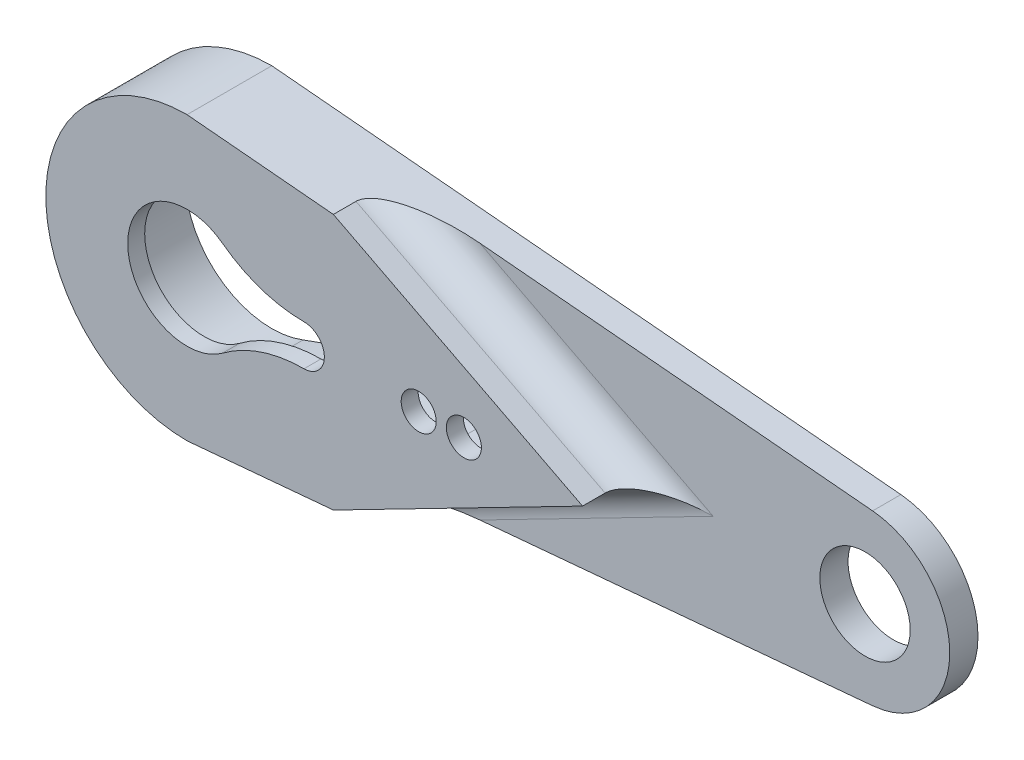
ISO-10303-21;
HEADER;
FILE_DESCRIPTION(('STEP AP214'),'2;1');
FILE_NAME('part.step','',(''),(''),'','','');
FILE_SCHEMA(('AUTOMOTIVE_DESIGN { 1 0 10303 214 1 1 1 1 }'));
ENDSEC;
DATA;
#1=APPLICATION_CONTEXT('core data for automotive mechanical design processes');
#2=APPLICATION_PROTOCOL_DEFINITION('international standard','automotive_design',2000,#1);
#3=PRODUCT_CONTEXT('',#1,'mechanical');
#4=PRODUCT('Part','Part','',(#3));
#5=PRODUCT_RELATED_PRODUCT_CATEGORY('part','',(#4));
#6=PRODUCT_DEFINITION_FORMATION('','',#4);
#7=PRODUCT_DEFINITION_CONTEXT('part definition',#1,'design');
#8=PRODUCT_DEFINITION('design','',#6,#7);
#9=PRODUCT_DEFINITION_SHAPE('','',#8);
#10=(LENGTH_UNIT() NAMED_UNIT(*) SI_UNIT(.MILLI.,.METRE.));
#11=(NAMED_UNIT(*) PLANE_ANGLE_UNIT() SI_UNIT($,.RADIAN.));
#12=(NAMED_UNIT(*) SI_UNIT($,.STERADIAN.) SOLID_ANGLE_UNIT());
#13=UNCERTAINTY_MEASURE_WITH_UNIT(LENGTH_MEASURE(1.E-05),#10,'distance_accuracy_value','');
#14=(GEOMETRIC_REPRESENTATION_CONTEXT(3) GLOBAL_UNCERTAINTY_ASSIGNED_CONTEXT((#13)) GLOBAL_UNIT_ASSIGNED_CONTEXT((#10,
#11,#12)) REPRESENTATION_CONTEXT('',''));
#15=CARTESIAN_POINT('',(0.,0.,0.));
#16=DIRECTION('',(0.,0.,1.));
#17=DIRECTION('',(1.,0.,0.));
#18=AXIS2_PLACEMENT_3D('',#15,#16,#17);
#19=CARTESIAN_POINT('',(55.,0.,-3.75));
#20=DIRECTION('',(0.,0.,1.));
#21=DIRECTION('',(1.,0.,0.));
#22=AXIS2_PLACEMENT_3D('',#19,#20,#21);
#23=CYLINDRICAL_SURFACE('',#22,7.5);
#24=CARTESIAN_POINT('',(55.,0.,-1.25));
#25=DIRECTION('',(0.,0.,1.));
#26=DIRECTION('',(1.,0.,0.));
#27=AXIS2_PLACEMENT_3D('',#24,#25,#26);
#28=CIRCLE('',#27,7.5);
#29=CARTESIAN_POINT('',(55.6749027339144,-7.46957202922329,-1.25));
#30=VERTEX_POINT('',#29);
#31=CARTESIAN_POINT('',(55.6749027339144,7.46957202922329,-1.25));
#32=VERTEX_POINT('',#31);
#33=EDGE_CURVE('E194',#30,#32,#28,.T.);
#34=ORIENTED_EDGE('',*,*,#33,.F.);
#35=DIRECTION('',(0.,0.,1.));
#36=VECTOR('',#35,1.);
#37=CARTESIAN_POINT('',(55.6749027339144,-7.46957202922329,-3.75));
#38=LINE('',#37,#36);
#39=CARTESIAN_POINT('',(55.6749027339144,-7.46957202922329,-3.75));
#40=VERTEX_POINT('',#39);
#41=EDGE_CURVE('E293',#40,#30,#38,.T.);
#42=ORIENTED_EDGE('',*,*,#41,.F.);
#43=CARTESIAN_POINT('',(55.,0.,-3.75));
#44=DIRECTION('',(0.,0.,1.));
#45=DIRECTION('',(1.,0.,0.));
#46=AXIS2_PLACEMENT_3D('',#43,#44,#45);
#47=CIRCLE('',#46,7.5);
#48=CARTESIAN_POINT('',(55.6749027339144,7.46957202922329,-3.75));
#49=VERTEX_POINT('',#48);
#50=EDGE_CURVE('E282',#49,#40,#47,.F.);
#51=ORIENTED_EDGE('',*,*,#50,.F.);
#52=DIRECTION('',(0.,0.,1.));
#53=VECTOR('',#52,1.);
#54=CARTESIAN_POINT('',(55.6749027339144,7.46957202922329,-3.75));
#55=LINE('',#54,#53);
#56=EDGE_CURVE('E289',#49,#32,#55,.T.);
#57=ORIENTED_EDGE('',*,*,#56,.T.);
#58=EDGE_LOOP('',(#34,#42,#51,#57));
#59=FACE_BOUND('',#58,.T.);
#60=ADVANCED_FACE('F40',(#59),#23,.T.);
#61=CARTESIAN_POINT('',(55.,0.,-3.75));
#62=DIRECTION('',(0.,0.,1.));
#63=DIRECTION('',(1.,0.,0.));
#64=AXIS2_PLACEMENT_3D('',#61,#62,#63);
#65=CYLINDRICAL_SURFACE('',#64,3.99999999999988);
#66=CARTESIAN_POINT('',(55.,0.,-3.75));
#67=DIRECTION('',(0.,0.,1.));
#68=DIRECTION('',(1.,0.,0.));
#69=AXIS2_PLACEMENT_3D('',#66,#67,#68);
#70=CIRCLE('',#69,3.99999999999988);
#71=CARTESIAN_POINT('',(58.9999999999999,0.,-3.75));
#72=VERTEX_POINT('',#71);
#73=EDGE_CURVE('E271',#72,#72,#70,.T.);
#74=ORIENTED_EDGE('',*,*,#73,.F.);
#75=EDGE_LOOP('',(#74));
#76=FACE_BOUND('',#75,.T.);
#77=CARTESIAN_POINT('',(55.,0.,-1.25));
#78=DIRECTION('',(0.,0.,1.));
#79=DIRECTION('',(1.,0.,0.));
#80=AXIS2_PLACEMENT_3D('',#77,#78,#79);
#81=CIRCLE('',#80,3.99999999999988);
#82=CARTESIAN_POINT('',(58.9999999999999,0.,-1.25));
#83=VERTEX_POINT('',#82);
#84=EDGE_CURVE('E190',#83,#83,#81,.F.);
#85=ORIENTED_EDGE('',*,*,#84,.F.);
#86=EDGE_LOOP('',(#85));
#87=FACE_BOUND('',#86,.T.);
#88=ADVANCED_FACE('F366',(#76,#87),#65,.F.);
#89=CARTESIAN_POINT('',(24.5,0.,-3.75));
#90=DIRECTION('',(0.,0.,1.));
#91=DIRECTION('',(1.,0.,0.));
#92=AXIS2_PLACEMENT_3D('',#89,#90,#91);
#93=CYLINDRICAL_SURFACE('',#92,3.80000000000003);
#94=CARTESIAN_POINT('',(24.5,0.,2.25));
#95=DIRECTION('',(0.,0.,1.));
#96=DIRECTION('',(1.,0.,0.));
#97=AXIS2_PLACEMENT_3D('',#94,#95,#96);
#98=CIRCLE('',#97,3.80000000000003);
#99=CARTESIAN_POINT('',(24.5,-3.80000000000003,2.25));
#100=VERTEX_POINT('',#99);
#101=CARTESIAN_POINT('',(24.5,3.80000000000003,2.25));
#102=VERTEX_POINT('',#101);
#103=EDGE_CURVE('E237',#100,#102,#98,.T.);
#104=ORIENTED_EDGE('',*,*,#103,.T.);
#105=DIRECTION('',(0.,0.,1.));
#106=VECTOR('',#105,1.);
#107=CARTESIAN_POINT('',(24.5,3.80000000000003,-3.75));
#108=LINE('',#107,#106);
#109=CARTESIAN_POINT('',(24.5,3.80000000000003,-3.75));
#110=VERTEX_POINT('',#109);
#111=EDGE_CURVE('E301',#110,#102,#108,.T.);
#112=ORIENTED_EDGE('',*,*,#111,.F.);
#113=CARTESIAN_POINT('',(24.5,0.,-3.75));
#114=DIRECTION('',(0.,0.,1.));
#115=DIRECTION('',(1.,0.,0.));
#116=AXIS2_PLACEMENT_3D('',#113,#114,#115);
#117=CIRCLE('',#116,3.80000000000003);
#118=CARTESIAN_POINT('',(24.5,-3.80000000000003,-3.75));
#119=VERTEX_POINT('',#118);
#120=EDGE_CURVE('E257',#119,#110,#117,.T.);
#121=ORIENTED_EDGE('',*,*,#120,.F.);
#122=DIRECTION('',(0.,0.,1.));
#123=VECTOR('',#122,1.);
#124=CARTESIAN_POINT('',(24.5,-3.80000000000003,-3.75));
#125=LINE('',#124,#123);
#126=EDGE_CURVE('E284',#119,#100,#125,.T.);
#127=ORIENTED_EDGE('',*,*,#126,.T.);
#128=EDGE_LOOP('',(#104,#112,#121,#127));
#129=FACE_BOUND('',#128,.T.);
#130=ADVANCED_FACE('F371',(#129),#93,.F.);
#131=CARTESIAN_POINT('',(0.,3.80000000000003,-3.75));
#132=DIRECTION('',(0.,-1.,0.));
#133=DIRECTION('',(1.,0.,0.));
#134=AXIS2_PLACEMENT_3D('',#131,#132,#133);
#135=PLANE('',#134);
#136=ORIENTED_EDGE('',*,*,#111,.T.);
#137=DIRECTION('',(-1.,0.,0.));
#138=VECTOR('',#137,1.);
#139=CARTESIAN_POINT('',(20.5845093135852,3.80000000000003,2.25));
#140=LINE('',#139,#138);
#141=CARTESIAN_POINT('',(20.5845093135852,3.80000000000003,2.25));
#142=VERTEX_POINT('',#141);
#143=EDGE_CURVE('E245',#102,#142,#140,.T.);
#144=ORIENTED_EDGE('',*,*,#143,.T.);
#145=DIRECTION('',(0.,0.,1.));
#146=VECTOR('',#145,1.);
#147=CARTESIAN_POINT('',(20.5845093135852,3.80000000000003,-3.75));
#148=LINE('',#147,#146);
#149=CARTESIAN_POINT('',(20.5845093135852,3.80000000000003,-3.75));
#150=VERTEX_POINT('',#149);
#151=EDGE_CURVE('E304',#150,#142,#148,.T.);
#152=ORIENTED_EDGE('',*,*,#151,.F.);
#153=DIRECTION('',(1.,0.,0.));
#154=VECTOR('',#153,1.);
#155=CARTESIAN_POINT('',(0.,3.80000000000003,-3.75));
#156=LINE('',#155,#154);
#157=EDGE_CURVE('E268',#150,#110,#156,.T.);
#158=ORIENTED_EDGE('',*,*,#157,.T.);
#159=EDGE_LOOP('',(#136,#144,#152,#158));
#160=FACE_BOUND('',#159,.T.);
#161=ADVANCED_FACE('F421',(#160),#135,.T.);
#162=CARTESIAN_POINT('',(20.5845093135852,53.103834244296,-3.75));
#163=DIRECTION('',(0.,0.,1.));
#164=DIRECTION('',(1.,0.,0.));
#165=AXIS2_PLACEMENT_3D('',#162,#163,#164);
#166=CYLINDRICAL_SURFACE('',#165,49.303834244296);
#167=ORIENTED_EDGE('',*,*,#151,.T.);
#168=CARTESIAN_POINT('',(20.5845093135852,53.103834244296,2.25));
#169=DIRECTION('',(0.,0.,-1.));
#170=DIRECTION('',(1.,0.,0.));
#171=AXIS2_PLACEMENT_3D('',#168,#169,#170);
#172=CIRCLE('',#171,49.303834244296);
#173=CARTESIAN_POINT('',(2.76489718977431,7.13287063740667,2.25));
#174=VERTEX_POINT('',#173);
#175=EDGE_CURVE('E247',#142,#174,#172,.T.);
#176=ORIENTED_EDGE('',*,*,#175,.T.);
#177=DIRECTION('',(0.,0.,1.));
#178=VECTOR('',#177,1.);
#179=CARTESIAN_POINT('',(2.76489718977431,7.13287063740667,-3.75));
#180=LINE('',#179,#178);
#181=CARTESIAN_POINT('',(2.76489718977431,7.13287063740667,-3.75));
#182=VERTEX_POINT('',#181);
#183=EDGE_CURVE('E307',#182,#174,#180,.T.);
#184=ORIENTED_EDGE('',*,*,#183,.F.);
#185=CARTESIAN_POINT('',(20.5845093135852,53.103834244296,-3.75));
#186=DIRECTION('',(0.,0.,1.));
#187=DIRECTION('',(1.,0.,0.));
#188=AXIS2_PLACEMENT_3D('',#185,#186,#187);
#189=CIRCLE('',#188,49.303834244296);
#190=EDGE_CURVE('E265',#182,#150,#189,.T.);
#191=ORIENTED_EDGE('',*,*,#190,.T.);
#192=EDGE_LOOP('',(#167,#176,#184,#191));
#193=FACE_BOUND('',#192,.T.);
#194=ADVANCED_FACE('F434',(#193),#166,.T.);
#195=CARTESIAN_POINT('',(0.,0.,-3.75));
#196=DIRECTION('',(0.,0.,1.));
#197=DIRECTION('',(1.,0.,0.));
#198=AXIS2_PLACEMENT_3D('',#195,#196,#197);
#199=CYLINDRICAL_SURFACE('',#198,7.65000000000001);
#200=CARTESIAN_POINT('',(0.,0.,2.25));
#201=DIRECTION('',(0.,0.,1.));
#202=DIRECTION('',(1.,0.,0.));
#203=AXIS2_PLACEMENT_3D('',#200,#201,#202);
#204=CIRCLE('',#203,7.65000000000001);
#205=CARTESIAN_POINT('',(2.76489718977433,-7.13287063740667,2.25));
#206=VERTEX_POINT('',#205);
#207=EDGE_CURVE('E249',#174,#206,#204,.T.);
#208=ORIENTED_EDGE('',*,*,#207,.T.);
#209=DIRECTION('',(0.,0.,1.));
#210=VECTOR('',#209,1.);
#211=CARTESIAN_POINT('',(2.76489718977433,-7.13287063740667,-3.75));
#212=LINE('',#211,#210);
#213=CARTESIAN_POINT('',(2.76489718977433,-7.13287063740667,-3.75));
#214=VERTEX_POINT('',#213);
#215=EDGE_CURVE('E310',#214,#206,#212,.T.);
#216=ORIENTED_EDGE('',*,*,#215,.F.);
#217=CARTESIAN_POINT('',(0.,0.,-3.75));
#218=DIRECTION('',(0.,0.,1.));
#219=DIRECTION('',(1.,0.,0.));
#220=AXIS2_PLACEMENT_3D('',#217,#218,#219);
#221=CIRCLE('',#220,7.65000000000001);
#222=EDGE_CURVE('E263',#182,#214,#221,.T.);
#223=ORIENTED_EDGE('',*,*,#222,.F.);
#224=ORIENTED_EDGE('',*,*,#183,.T.);
#225=EDGE_LOOP('',(#208,#216,#223,#224));
#226=FACE_BOUND('',#225,.T.);
#227=ADVANCED_FACE('F430',(#226),#199,.F.);
#228=CARTESIAN_POINT('',(20.5845093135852,-53.103834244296,-3.75));
#229=DIRECTION('',(0.,0.,1.));
#230=DIRECTION('',(1.,0.,0.));
#231=AXIS2_PLACEMENT_3D('',#228,#229,#230);
#232=CYLINDRICAL_SURFACE('',#231,49.303834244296);
#233=CARTESIAN_POINT('',(20.5845093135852,-53.103834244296,2.25));
#234=DIRECTION('',(0.,0.,-1.));
#235=DIRECTION('',(1.,0.,0.));
#236=AXIS2_PLACEMENT_3D('',#233,#234,#235);
#237=CIRCLE('',#236,49.303834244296);
#238=CARTESIAN_POINT('',(20.5845093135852,-3.80000000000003,2.25));
#239=VERTEX_POINT('',#238);
#240=EDGE_CURVE('E251',#206,#239,#237,.T.);
#241=ORIENTED_EDGE('',*,*,#240,.T.);
#242=DIRECTION('',(0.,0.,1.));
#243=VECTOR('',#242,1.);
#244=CARTESIAN_POINT('',(20.5845093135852,-3.80000000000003,-3.75));
#245=LINE('',#244,#243);
#246=CARTESIAN_POINT('',(20.5845093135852,-3.80000000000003,-3.75));
#247=VERTEX_POINT('',#246);
#248=EDGE_CURVE('E313',#247,#239,#245,.T.);
#249=ORIENTED_EDGE('',*,*,#248,.F.);
#250=CARTESIAN_POINT('',(20.5845093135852,-53.103834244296,-3.75));
#251=DIRECTION('',(0.,0.,1.));
#252=DIRECTION('',(1.,0.,0.));
#253=AXIS2_PLACEMENT_3D('',#250,#251,#252);
#254=CIRCLE('',#253,49.303834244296);
#255=EDGE_CURVE('E261',#214,#247,#254,.F.);
#256=ORIENTED_EDGE('',*,*,#255,.F.);
#257=ORIENTED_EDGE('',*,*,#215,.T.);
#258=EDGE_LOOP('',(#241,#249,#256,#257));
#259=FACE_BOUND('',#258,.T.);
#260=ADVANCED_FACE('F426',(#259),#232,.T.);
#261=CARTESIAN_POINT('',(0.,-3.80000000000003,-3.75));
#262=DIRECTION('',(0.,-1.,0.));
#263=DIRECTION('',(0.,0.,-1.));
#264=AXIS2_PLACEMENT_3D('',#261,#262,#263);
#265=PLANE('',#264);
#266=DIRECTION('',(1.,0.,0.));
#267=VECTOR('',#266,1.);
#268=CARTESIAN_POINT('',(20.5845093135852,-3.80000000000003,2.25));
#269=LINE('',#268,#267);
#270=EDGE_CURVE('E254',#239,#100,#269,.T.);
#271=ORIENTED_EDGE('',*,*,#270,.T.);
#272=ORIENTED_EDGE('',*,*,#126,.F.);
#273=DIRECTION('',(1.,0.,0.));
#274=VECTOR('',#273,1.);
#275=CARTESIAN_POINT('',(0.,-3.80000000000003,-3.75));
#276=LINE('',#275,#274);
#277=EDGE_CURVE('E259',#247,#119,#276,.T.);
#278=ORIENTED_EDGE('',*,*,#277,.F.);
#279=ORIENTED_EDGE('',*,*,#248,.T.);
#280=EDGE_LOOP('',(#271,#272,#278,#279));
#281=FACE_BOUND('',#280,.T.);
#282=ADVANCED_FACE('F423',(#281),#265,.F.);
#283=CARTESIAN_POINT('',(1.12027435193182,12.3987791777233,-3.75));
#284=DIRECTION('',(-0.0899870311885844,-0.995942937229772,0.));
#285=DIRECTION('',(0.995942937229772,-0.0899870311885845,0.));
#286=AXIS2_PLACEMENT_3D('',#283,#284,#285);
#287=PLANE('',#286);
#288=DIRECTION('',(0.995942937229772,-0.0899870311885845,0.));
#289=VECTOR('',#288,1.);
#290=CARTESIAN_POINT('',(1.12027435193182,12.3987791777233,3.75));
#291=LINE('',#290,#289);
#292=CARTESIAN_POINT('',(0.,12.5,3.75));
#293=VERTEX_POINT('',#292);
#294=CARTESIAN_POINT('',(12.9502697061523,11.329896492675,3.75));
#295=VERTEX_POINT('',#294);
#296=EDGE_CURVE('E256',#293,#295,#291,.T.);
#297=ORIENTED_EDGE('',*,*,#296,.T.);
#298=DIRECTION('',(0.,0.,1.));
#299=VECTOR('',#298,1.);
#300=CARTESIAN_POINT('',(12.9502697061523,11.329896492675,-1.25));
#301=LINE('',#300,#299);
#302=CARTESIAN_POINT('',(12.9502697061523,11.329896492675,1.75));
#303=VERTEX_POINT('',#302);
#304=EDGE_CURVE('E177',#303,#295,#301,.T.);
#305=ORIENTED_EDGE('',*,*,#304,.F.);
#306=CARTESIAN_POINT('',(20.9149072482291,10.6102628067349,1.75));
#307=DIRECTION('',(-0.0899870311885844,-0.995942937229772,0.));
#308=DIRECTION('',(0.995942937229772,-0.0899870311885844,0.));
#309=AXIS2_PLACEMENT_3D('',#306,#307,#308);
#310=ELLIPSE('',#309,7.99708220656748,3.);
#311=CARTESIAN_POINT('',(20.9149072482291,10.6102628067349,-1.25));
#312=VERTEX_POINT('',#311);
#313=EDGE_CURVE('E11',#303,#312,#310,.T.);
#314=ORIENTED_EDGE('',*,*,#313,.T.);
#315=DIRECTION('',(-0.995942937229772,0.0899870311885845,0.));
#316=VECTOR('',#315,1.);
#317=CARTESIAN_POINT('',(1.12027435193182,12.3987791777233,-1.25));
#318=LINE('',#317,#316);
#319=EDGE_CURVE('E196',#32,#312,#318,.T.);
#320=ORIENTED_EDGE('',*,*,#319,.F.);
#321=ORIENTED_EDGE('',*,*,#56,.F.);
#322=DIRECTION('',(0.995942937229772,-0.0899870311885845,0.));
#323=VECTOR('',#322,1.);
#324=CARTESIAN_POINT('',(1.12027435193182,12.3987791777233,-3.75));
#325=LINE('',#324,#323);
#326=CARTESIAN_POINT('',(0.,12.5,-3.75));
#327=VERTEX_POINT('',#326);
#328=EDGE_CURVE('E274',#327,#49,#325,.T.);
#329=ORIENTED_EDGE('',*,*,#328,.F.);
#330=DIRECTION('',(0.,0.,1.));
#331=VECTOR('',#330,1.);
#332=CARTESIAN_POINT('',(0.,12.5,-3.75));
#333=LINE('',#332,#331);
#334=EDGE_CURVE('E299',#327,#293,#333,.T.);
#335=ORIENTED_EDGE('',*,*,#334,.T.);
#336=EDGE_LOOP('',(#297,#305,#314,#320,#321,#329,#335));
#337=FACE_BOUND('',#336,.T.);
#338=ADVANCED_FACE('F338',(#337),#287,.F.);
#339=CARTESIAN_POINT('',(1.12027435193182,-12.3987791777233,-3.75));
#340=DIRECTION('',(-0.0899870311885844,0.995942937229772,0.));
#341=DIRECTION('',(-0.995942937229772,-0.0899870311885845,0.));
#342=AXIS2_PLACEMENT_3D('',#339,#340,#341);
#343=PLANE('',#342);
#344=DIRECTION('',(0.995942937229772,0.0899870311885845,0.));
#345=VECTOR('',#344,1.);
#346=CARTESIAN_POINT('',(1.12027435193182,-12.3987791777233,-1.25));
#347=LINE('',#346,#345);
#348=CARTESIAN_POINT('',(20.9149072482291,-10.6102628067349,-1.25));
#349=VERTEX_POINT('',#348);
#350=EDGE_CURVE('E192',#349,#30,#347,.T.);
#351=ORIENTED_EDGE('',*,*,#350,.F.);
#352=CARTESIAN_POINT('',(20.9149072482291,-10.6102628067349,1.75));
#353=DIRECTION('',(-0.0899870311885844,0.995942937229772,0.));
#354=DIRECTION('',(-0.995942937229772,-0.0899870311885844,0.));
#355=AXIS2_PLACEMENT_3D('',#352,#353,#354);
#356=ELLIPSE('',#355,7.99708220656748,3.);
#357=CARTESIAN_POINT('',(12.9502697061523,-11.329896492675,1.75));
#358=VERTEX_POINT('',#357);
#359=EDGE_CURVE('E49',#349,#358,#356,.T.);
#360=ORIENTED_EDGE('',*,*,#359,.T.);
#361=DIRECTION('',(0.,0.,1.));
#362=VECTOR('',#361,1.);
#363=CARTESIAN_POINT('',(12.9502697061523,-11.329896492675,-1.25));
#364=LINE('',#363,#362);
#365=CARTESIAN_POINT('',(12.9502697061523,-11.329896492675,3.75));
#366=VERTEX_POINT('',#365);
#367=EDGE_CURVE('E187',#358,#366,#364,.T.);
#368=ORIENTED_EDGE('',*,*,#367,.T.);
#369=DIRECTION('',(-0.995942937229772,-0.0899870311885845,0.));
#370=VECTOR('',#369,1.);
#371=CARTESIAN_POINT('',(1.12027435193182,-12.3987791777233,3.75));
#372=LINE('',#371,#370);
#373=CARTESIAN_POINT('',(0.,-12.5,3.75));
#374=VERTEX_POINT('',#373);
#375=EDGE_CURVE('E185',#366,#374,#372,.T.);
#376=ORIENTED_EDGE('',*,*,#375,.T.);
#377=DIRECTION('',(0.,0.,1.));
#378=VECTOR('',#377,1.);
#379=CARTESIAN_POINT('',(0.,-12.5,-3.75));
#380=LINE('',#379,#378);
#381=CARTESIAN_POINT('',(0.,-12.5,-3.75));
#382=VERTEX_POINT('',#381);
#383=EDGE_CURVE('E296',#382,#374,#380,.T.);
#384=ORIENTED_EDGE('',*,*,#383,.F.);
#385=DIRECTION('',(-0.995942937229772,-0.0899870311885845,0.));
#386=VECTOR('',#385,1.);
#387=CARTESIAN_POINT('',(1.12027435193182,-12.3987791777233,-3.75));
#388=LINE('',#387,#386);
#389=EDGE_CURVE('E280',#40,#382,#388,.T.);
#390=ORIENTED_EDGE('',*,*,#389,.F.);
#391=ORIENTED_EDGE('',*,*,#41,.T.);
#392=EDGE_LOOP('',(#351,#360,#368,#376,#384,#390,#391));
#393=FACE_BOUND('',#392,.T.);
#394=ADVANCED_FACE('F327',(#393),#343,.F.);
#395=CARTESIAN_POINT('',(0.,0.,-3.75));
#396=DIRECTION('',(0.,0.,1.));
#397=DIRECTION('',(1.,0.,0.));
#398=AXIS2_PLACEMENT_3D('',#395,#396,#397);
#399=CYLINDRICAL_SURFACE('',#398,12.5);
#400=CARTESIAN_POINT('',(0.,0.,3.75));
#401=DIRECTION('',(0.,0.,1.));
#402=DIRECTION('',(1.,0.,0.));
#403=AXIS2_PLACEMENT_3D('',#400,#401,#402);
#404=CIRCLE('',#403,12.5);
#405=EDGE_CURVE('E286',#293,#374,#404,.T.);
#406=ORIENTED_EDGE('',*,*,#405,.F.);
#407=ORIENTED_EDGE('',*,*,#334,.F.);
#408=CARTESIAN_POINT('',(0.,0.,-3.75));
#409=DIRECTION('',(0.,0.,1.));
#410=DIRECTION('',(1.,0.,0.));
#411=AXIS2_PLACEMENT_3D('',#408,#409,#410);
#412=CIRCLE('',#411,12.5);
#413=EDGE_CURVE('E277',#327,#382,#412,.T.);
#414=ORIENTED_EDGE('',*,*,#413,.T.);
#415=ORIENTED_EDGE('',*,*,#383,.T.);
#416=EDGE_LOOP('',(#406,#407,#414,#415));
#417=FACE_BOUND('',#416,.T.);
#418=ADVANCED_FACE('F354',(#417),#399,.T.);
#419=CARTESIAN_POINT('',(0.,0.,-3.75));
#420=DIRECTION('',(0.,0.,1.));
#421=DIRECTION('',(1.,0.,0.));
#422=AXIS2_PLACEMENT_3D('',#419,#420,#421);
#423=PLANE('',#422);
#424=ORIENTED_EDGE('',*,*,#120,.T.);
#425=ORIENTED_EDGE('',*,*,#157,.F.);
#426=ORIENTED_EDGE('',*,*,#190,.F.);
#427=ORIENTED_EDGE('',*,*,#222,.T.);
#428=ORIENTED_EDGE('',*,*,#255,.T.);
#429=ORIENTED_EDGE('',*,*,#277,.T.);
#430=EDGE_LOOP('',(#424,#425,#426,#427,#428,#429));
#431=FACE_BOUND('',#430,.T.);
#432=ORIENTED_EDGE('',*,*,#73,.T.);
#433=EDGE_LOOP('',(#432));
#434=FACE_BOUND('',#433,.T.);
#435=ORIENTED_EDGE('',*,*,#328,.T.);
#436=ORIENTED_EDGE('',*,*,#50,.T.);
#437=ORIENTED_EDGE('',*,*,#389,.T.);
#438=ORIENTED_EDGE('',*,*,#413,.F.);
#439=EDGE_LOOP('',(#435,#436,#437,#438));
#440=FACE_BOUND('',#439,.T.);
#441=ADVANCED_FACE('F350',(#431,#434,#440),#423,.F.);
#442=CARTESIAN_POINT('',(0.,0.,3.75));
#443=DIRECTION('',(0.,0.,1.));
#444=DIRECTION('',(1.,0.,0.));
#445=AXIS2_PLACEMENT_3D('',#442,#443,#444);
#446=PLANE('',#445);
#447=ORIENTED_EDGE('',*,*,#375,.F.);
#448=DIRECTION('',(-0.889451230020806,-0.457030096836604,0.));
#449=VECTOR('',#448,1.);
#450=CARTESIAN_POINT('',(35.,0.,3.75));
#451=LINE('',#450,#449);
#452=CARTESIAN_POINT('',(35.,0.,3.75));
#453=VERTEX_POINT('',#452);
#454=EDGE_CURVE('E171',#453,#366,#451,.T.);
#455=ORIENTED_EDGE('',*,*,#454,.F.);
#456=DIRECTION('',(0.889451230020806,-0.457030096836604,0.));
#457=VECTOR('',#456,1.);
#458=CARTESIAN_POINT('',(12.9502697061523,11.329896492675,3.75));
#459=LINE('',#458,#457);
#460=EDGE_CURVE('E173',#295,#453,#459,.T.);
#461=ORIENTED_EDGE('',*,*,#460,.F.);
#462=ORIENTED_EDGE('',*,*,#296,.F.);
#463=ORIENTED_EDGE('',*,*,#405,.T.);
#464=EDGE_LOOP('',(#447,#455,#461,#462,#463));
#465=FACE_BOUND('',#464,.T.);
#466=CARTESIAN_POINT('',(20.5,0.,3.75));
#467=DIRECTION('',(0.,0.,1.));
#468=DIRECTION('',(1.,0.,0.));
#469=AXIS2_PLACEMENT_3D('',#466,#467,#468);
#470=CIRCLE('',#469,1.55000000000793);
#471=CARTESIAN_POINT('',(22.0500000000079,0.,3.75));
#472=VERTEX_POINT('',#471);
#473=EDGE_CURVE('E199',#472,#472,#470,.T.);
#474=ORIENTED_EDGE('',*,*,#473,.F.);
#475=EDGE_LOOP('',(#474));
#476=FACE_BOUND('',#475,.T.);
#477=CARTESIAN_POINT('',(24.5,0.,3.75));
#478=DIRECTION('',(0.,0.,1.));
#479=DIRECTION('',(1.,0.,0.));
#480=AXIS2_PLACEMENT_3D('',#477,#478,#479);
#481=CIRCLE('',#480,1.55000000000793);
#482=CARTESIAN_POINT('',(26.0500000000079,0.,3.75));
#483=VERTEX_POINT('',#482);
#484=EDGE_CURVE('E203',#483,#483,#481,.T.);
#485=ORIENTED_EDGE('',*,*,#484,.F.);
#486=EDGE_LOOP('',(#485));
#487=FACE_BOUND('',#486,.T.);
#488=CARTESIAN_POINT('',(10.3500000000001,13.8,3.75));
#489=DIRECTION('',(0.,0.,-1.));
#490=DIRECTION('',(1.,0.,0.));
#491=AXIS2_PLACEMENT_3D('',#488,#489,#490);
#492=CIRCLE('',#491,12.);
#493=CARTESIAN_POINT('',(10.3500000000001,1.80000000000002,3.75));
#494=VERTEX_POINT('',#493);
#495=CARTESIAN_POINT('',(3.15000000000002,4.19999999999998,3.75));
#496=VERTEX_POINT('',#495);
#497=EDGE_CURVE('E209',#494,#496,#492,.T.);
#498=ORIENTED_EDGE('',*,*,#497,.F.);
#499=CARTESIAN_POINT('',(10.3500000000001,0.,3.75));
#500=DIRECTION('',(0.,0.,1.));
#501=DIRECTION('',(1.,0.,0.));
#502=AXIS2_PLACEMENT_3D('',#499,#500,#501);
#503=CIRCLE('',#502,1.8);
#504=CARTESIAN_POINT('',(10.3500000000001,-1.79999999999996,3.75));
#505=VERTEX_POINT('',#504);
#506=EDGE_CURVE('E216',#505,#494,#503,.T.);
#507=ORIENTED_EDGE('',*,*,#506,.F.);
#508=CARTESIAN_POINT('',(10.35,-13.8,3.75));
#509=DIRECTION('',(0.,0.,-1.));
#510=DIRECTION('',(-1.,0.,0.));
#511=AXIS2_PLACEMENT_3D('',#508,#509,#510);
#512=CIRCLE('',#511,12.);
#513=CARTESIAN_POINT('',(3.15000000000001,-4.19999999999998,3.75));
#514=VERTEX_POINT('',#513);
#515=EDGE_CURVE('E230',#514,#505,#512,.T.);
#516=ORIENTED_EDGE('',*,*,#515,.F.);
#517=CARTESIAN_POINT('',(0.,0.,3.75));
#518=DIRECTION('',(0.,0.,1.));
#519=DIRECTION('',(1.,0.,0.));
#520=AXIS2_PLACEMENT_3D('',#517,#518,#519);
#521=CIRCLE('',#520,5.25);
#522=EDGE_CURVE('E227',#496,#514,#521,.T.);
#523=ORIENTED_EDGE('',*,*,#522,.F.);
#524=EDGE_LOOP('',(#498,#507,#516,#523));
#525=FACE_BOUND('',#524,.T.);
#526=ADVANCED_FACE('F182',(#465,#476,#487,#525),#446,.T.);
#527=CARTESIAN_POINT('',(24.5,0.,2.25));
#528=DIRECTION('',(0.,0.,1.));
#529=DIRECTION('',(1.,0.,0.));
#530=AXIS2_PLACEMENT_3D('',#527,#528,#529);
#531=PLANE('',#530);
#532=CARTESIAN_POINT('',(20.5,0.,2.25));
#533=DIRECTION('',(0.,0.,1.));
#534=DIRECTION('',(1.,0.,0.));
#535=AXIS2_PLACEMENT_3D('',#532,#533,#534);
#536=CIRCLE('',#535,1.55000000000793);
#537=CARTESIAN_POINT('',(22.0500000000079,0.,2.25));
#538=VERTEX_POINT('',#537);
#539=EDGE_CURVE('E200',#538,#538,#536,.T.);
#540=ORIENTED_EDGE('',*,*,#539,.T.);
#541=EDGE_LOOP('',(#540));
#542=FACE_BOUND('',#541,.T.);
#543=CARTESIAN_POINT('',(24.5,0.,2.25));
#544=DIRECTION('',(0.,0.,1.));
#545=DIRECTION('',(1.,0.,0.));
#546=AXIS2_PLACEMENT_3D('',#543,#544,#545);
#547=CIRCLE('',#546,1.55000000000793);
#548=CARTESIAN_POINT('',(26.0500000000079,0.,2.25));
#549=VERTEX_POINT('',#548);
#550=EDGE_CURVE('E206',#549,#549,#547,.T.);
#551=ORIENTED_EDGE('',*,*,#550,.T.);
#552=EDGE_LOOP('',(#551));
#553=FACE_BOUND('',#552,.T.);
#554=CARTESIAN_POINT('',(10.3500000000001,0.,2.25));
#555=DIRECTION('',(0.,0.,1.));
#556=DIRECTION('',(1.,0.,0.));
#557=AXIS2_PLACEMENT_3D('',#554,#555,#556);
#558=CIRCLE('',#557,1.8);
#559=CARTESIAN_POINT('',(10.3500000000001,-1.79999999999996,2.25));
#560=VERTEX_POINT('',#559);
#561=CARTESIAN_POINT('',(10.3500000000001,1.80000000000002,2.25));
#562=VERTEX_POINT('',#561);
#563=EDGE_CURVE('E222',#560,#562,#558,.T.);
#564=ORIENTED_EDGE('',*,*,#563,.T.);
#565=CARTESIAN_POINT('',(10.3500000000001,13.8,2.25));
#566=DIRECTION('',(0.,0.,-1.));
#567=DIRECTION('',(1.,0.,0.));
#568=AXIS2_PLACEMENT_3D('',#565,#566,#567);
#569=CIRCLE('',#568,12.);
#570=CARTESIAN_POINT('',(3.15000000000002,4.19999999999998,2.25));
#571=VERTEX_POINT('',#570);
#572=EDGE_CURVE('E212',#562,#571,#569,.T.);
#573=ORIENTED_EDGE('',*,*,#572,.T.);
#574=CARTESIAN_POINT('',(0.,0.,2.25));
#575=DIRECTION('',(0.,0.,1.));
#576=DIRECTION('',(1.,0.,0.));
#577=AXIS2_PLACEMENT_3D('',#574,#575,#576);
#578=CIRCLE('',#577,5.25);
#579=CARTESIAN_POINT('',(3.15000000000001,-4.19999999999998,2.25));
#580=VERTEX_POINT('',#579);
#581=EDGE_CURVE('E215',#571,#580,#578,.T.);
#582=ORIENTED_EDGE('',*,*,#581,.T.);
#583=CARTESIAN_POINT('',(10.35,-13.8,2.25));
#584=DIRECTION('',(0.,0.,-1.));
#585=DIRECTION('',(-1.,0.,0.));
#586=AXIS2_PLACEMENT_3D('',#583,#584,#585);
#587=CIRCLE('',#586,12.);
#588=EDGE_CURVE('E219',#580,#560,#587,.T.);
#589=ORIENTED_EDGE('',*,*,#588,.T.);
#590=EDGE_LOOP('',(#564,#573,#582,#589));
#591=FACE_BOUND('',#590,.T.);
#592=ORIENTED_EDGE('',*,*,#103,.F.);
#593=ORIENTED_EDGE('',*,*,#270,.F.);
#594=ORIENTED_EDGE('',*,*,#240,.F.);
#595=ORIENTED_EDGE('',*,*,#207,.F.);
#596=ORIENTED_EDGE('',*,*,#175,.F.);
#597=ORIENTED_EDGE('',*,*,#143,.F.);
#598=EDGE_LOOP('',(#592,#593,#594,#595,#596,#597));
#599=FACE_BOUND('',#598,.T.);
#600=ADVANCED_FACE('F376',(#542,#553,#591,#599),#531,.F.);
#601=CARTESIAN_POINT('',(10.3500000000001,13.8,2.25));
#602=DIRECTION('',(0.,0.,1.));
#603=DIRECTION('',(1.,0.,0.));
#604=AXIS2_PLACEMENT_3D('',#601,#602,#603);
#605=CYLINDRICAL_SURFACE('',#604,12.);
#606=ORIENTED_EDGE('',*,*,#497,.T.);
#607=DIRECTION('',(0.,0.,1.));
#608=VECTOR('',#607,1.);
#609=CARTESIAN_POINT('',(3.15000000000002,4.19999999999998,2.25));
#610=LINE('',#609,#608);
#611=EDGE_CURVE('E225',#571,#496,#610,.T.);
#612=ORIENTED_EDGE('',*,*,#611,.F.);
#613=ORIENTED_EDGE('',*,*,#572,.F.);
#614=DIRECTION('',(0.,0.,1.));
#615=VECTOR('',#614,1.);
#616=CARTESIAN_POINT('',(10.3500000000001,1.80000000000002,2.25));
#617=LINE('',#616,#615);
#618=EDGE_CURVE('E235',#562,#494,#617,.T.);
#619=ORIENTED_EDGE('',*,*,#618,.T.);
#620=EDGE_LOOP('',(#606,#612,#613,#619));
#621=FACE_BOUND('',#620,.T.);
#622=ADVANCED_FACE('F380',(#621),#605,.T.);
#623=CARTESIAN_POINT('',(10.3500000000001,0.,2.25));
#624=DIRECTION('',(0.,0.,1.));
#625=DIRECTION('',(1.,0.,0.));
#626=AXIS2_PLACEMENT_3D('',#623,#624,#625);
#627=CYLINDRICAL_SURFACE('',#626,1.8);
#628=ORIENTED_EDGE('',*,*,#506,.T.);
#629=ORIENTED_EDGE('',*,*,#618,.F.);
#630=ORIENTED_EDGE('',*,*,#563,.F.);
#631=DIRECTION('',(0.,0.,1.));
#632=VECTOR('',#631,1.);
#633=CARTESIAN_POINT('',(10.3500000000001,-1.79999999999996,2.25));
#634=LINE('',#633,#632);
#635=EDGE_CURVE('E238',#560,#505,#634,.T.);
#636=ORIENTED_EDGE('',*,*,#635,.T.);
#637=EDGE_LOOP('',(#628,#629,#630,#636));
#638=FACE_BOUND('',#637,.T.);
#639=ADVANCED_FACE('F384',(#638),#627,.F.);
#640=CARTESIAN_POINT('',(10.35,-13.8,2.25));
#641=DIRECTION('',(0.,0.,1.));
#642=DIRECTION('',(1.,0.,0.));
#643=AXIS2_PLACEMENT_3D('',#640,#641,#642);
#644=CYLINDRICAL_SURFACE('',#643,12.);
#645=ORIENTED_EDGE('',*,*,#515,.T.);
#646=ORIENTED_EDGE('',*,*,#635,.F.);
#647=ORIENTED_EDGE('',*,*,#588,.F.);
#648=DIRECTION('',(0.,0.,1.));
#649=VECTOR('',#648,1.);
#650=CARTESIAN_POINT('',(3.15000000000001,-4.19999999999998,2.25));
#651=LINE('',#650,#649);
#652=EDGE_CURVE('E240',#580,#514,#651,.T.);
#653=ORIENTED_EDGE('',*,*,#652,.T.);
#654=EDGE_LOOP('',(#645,#646,#647,#653));
#655=FACE_BOUND('',#654,.T.);
#656=ADVANCED_FACE('F390',(#655),#644,.T.);
#657=CARTESIAN_POINT('',(0.,0.,2.25));
#658=DIRECTION('',(0.,0.,1.));
#659=DIRECTION('',(1.,0.,0.));
#660=AXIS2_PLACEMENT_3D('',#657,#658,#659);
#661=CYLINDRICAL_SURFACE('',#660,5.25);
#662=ORIENTED_EDGE('',*,*,#522,.T.);
#663=ORIENTED_EDGE('',*,*,#652,.F.);
#664=ORIENTED_EDGE('',*,*,#581,.F.);
#665=ORIENTED_EDGE('',*,*,#611,.T.);
#666=EDGE_LOOP('',(#662,#663,#664,#665));
#667=FACE_BOUND('',#666,.T.);
#668=ADVANCED_FACE('F386',(#667),#661,.F.);
#669=CARTESIAN_POINT('',(24.5,0.,2.25));
#670=DIRECTION('',(0.,0.,1.));
#671=DIRECTION('',(1.,0.,0.));
#672=AXIS2_PLACEMENT_3D('',#669,#670,#671);
#673=CYLINDRICAL_SURFACE('',#672,1.55000000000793);
#674=ORIENTED_EDGE('',*,*,#550,.F.);
#675=EDGE_LOOP('',(#674));
#676=FACE_BOUND('',#675,.T.);
#677=ORIENTED_EDGE('',*,*,#484,.T.);
#678=EDGE_LOOP('',(#677));
#679=FACE_BOUND('',#678,.T.);
#680=ADVANCED_FACE('F389',(#676,#679),#673,.F.);
#681=CARTESIAN_POINT('',(20.5,0.,2.25));
#682=DIRECTION('',(0.,0.,1.));
#683=DIRECTION('',(1.,0.,0.));
#684=AXIS2_PLACEMENT_3D('',#681,#682,#683);
#685=CYLINDRICAL_SURFACE('',#684,1.55000000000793);
#686=ORIENTED_EDGE('',*,*,#539,.F.);
#687=EDGE_LOOP('',(#686));
#688=FACE_BOUND('',#687,.T.);
#689=ORIENTED_EDGE('',*,*,#473,.T.);
#690=EDGE_LOOP('',(#689));
#691=FACE_BOUND('',#690,.T.);
#692=ADVANCED_FACE('F400',(#688,#691),#685,.F.);
#693=CARTESIAN_POINT('',(55.,0.,-1.25));
#694=DIRECTION('',(0.,0.,1.));
#695=DIRECTION('',(1.,0.,0.));
#696=AXIS2_PLACEMENT_3D('',#693,#694,#695);
#697=PLANE('',#696);
#698=DIRECTION('',(0.889451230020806,-0.457030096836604,0.));
#699=VECTOR('',#698,1.);
#700=CARTESIAN_POINT('',(52.1935601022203,-5.46176594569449,-1.25));
#701=LINE('',#700,#699);
#702=CARTESIAN_POINT('',(41.5641191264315,0.,-1.25));
#703=VERTEX_POINT('',#702);
#704=EDGE_CURVE('E292',#312,#703,#701,.T.);
#705=ORIENTED_EDGE('',*,*,#704,.T.);
#706=DIRECTION('',(-0.889451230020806,-0.457030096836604,0.));
#707=VECTOR('',#706,1.);
#708=CARTESIAN_POINT('',(52.1935601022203,5.46176594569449,-1.25));
#709=LINE('',#708,#707);
#710=EDGE_CURVE('E320',#703,#349,#709,.T.);
#711=ORIENTED_EDGE('',*,*,#710,.T.);
#712=ORIENTED_EDGE('',*,*,#350,.T.);
#713=ORIENTED_EDGE('',*,*,#33,.T.);
#714=ORIENTED_EDGE('',*,*,#319,.T.);
#715=EDGE_LOOP('',(#705,#711,#712,#713,#714));
#716=FACE_BOUND('',#715,.T.);
#717=ORIENTED_EDGE('',*,*,#84,.T.);
#718=EDGE_LOOP('',(#717));
#719=FACE_BOUND('',#718,.T.);
#720=ADVANCED_FACE('F341',(#716,#719),#697,.T.);
#721=CARTESIAN_POINT('',(12.9502697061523,11.329896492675,-1.25));
#722=DIRECTION('',(-0.457030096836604,-0.889451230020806,0.));
#723=DIRECTION('',(0.889451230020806,-0.457030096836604,0.));
#724=AXIS2_PLACEMENT_3D('',#721,#722,#723);
#725=PLANE('',#724);
#726=DIRECTION('',(0.,0.,1.));
#727=VECTOR('',#726,1.);
#728=CARTESIAN_POINT('',(35.,0.,-9.55405608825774));
#729=LINE('',#728,#727);
#730=CARTESIAN_POINT('',(35.,0.,1.75));
#731=VERTEX_POINT('',#730);
#732=EDGE_CURVE('E167',#731,#453,#729,.T.);
#733=ORIENTED_EDGE('',*,*,#732,.F.);
#734=DIRECTION('',(0.889451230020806,-0.457030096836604,0.));
#735=VECTOR('',#734,1.);
#736=CARTESIAN_POINT('',(12.9502697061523,11.329896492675,1.75));
#737=LINE('',#736,#735);
#738=EDGE_CURVE('E56',#731,#303,#737,.F.);
#739=ORIENTED_EDGE('',*,*,#738,.T.);
#740=ORIENTED_EDGE('',*,*,#304,.T.);
#741=ORIENTED_EDGE('',*,*,#460,.T.);
#742=EDGE_LOOP('',(#733,#739,#740,#741));
#743=FACE_BOUND('',#742,.T.);
#744=ADVANCED_FACE('F176',(#743),#725,.F.);
#745=CARTESIAN_POINT('',(35.,0.,-1.25));
#746=DIRECTION('',(-0.457030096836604,0.889451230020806,0.));
#747=DIRECTION('',(-0.889451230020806,-0.457030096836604,0.));
#748=AXIS2_PLACEMENT_3D('',#745,#746,#747);
#749=PLANE('',#748);
#750=ORIENTED_EDGE('',*,*,#367,.F.);
#751=DIRECTION('',(-0.889451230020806,-0.457030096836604,0.));
#752=VECTOR('',#751,1.);
#753=CARTESIAN_POINT('',(35.,0.,1.75));
#754=LINE('',#753,#752);
#755=EDGE_CURVE('E64',#358,#731,#754,.F.);
#756=ORIENTED_EDGE('',*,*,#755,.T.);
#757=ORIENTED_EDGE('',*,*,#732,.T.);
#758=ORIENTED_EDGE('',*,*,#454,.T.);
#759=EDGE_LOOP('',(#750,#756,#757,#758));
#760=FACE_BOUND('',#759,.T.);
#761=ADVANCED_FACE('F169',(#760),#749,.F.);
#762=CARTESIAN_POINT('',(52.1935601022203,-5.46176594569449,1.75));
#763=DIRECTION('',(0.889451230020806,-0.457030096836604,0.));
#764=DIRECTION('',(0.457030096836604,0.889451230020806,0.));
#765=AXIS2_PLACEMENT_3D('',#762,#763,#764);
#766=CYLINDRICAL_SURFACE('',#765,3.);
#767=ORIENTED_EDGE('',*,*,#313,.F.);
#768=ORIENTED_EDGE('',*,*,#738,.F.);
#769=CARTESIAN_POINT('',(41.5641191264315,0.,1.75));
#770=DIRECTION('',(0.,-1.,0.));
#771=DIRECTION('',(1.,0.,0.));
#772=AXIS2_PLACEMENT_3D('',#769,#770,#771);
#773=ELLIPSE('',#772,6.56411912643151,3.);
#774=EDGE_CURVE('E44',#703,#731,#773,.F.);
#775=ORIENTED_EDGE('',*,*,#774,.F.);
#776=ORIENTED_EDGE('',*,*,#704,.F.);
#777=EDGE_LOOP('',(#767,#768,#775,#776));
#778=FACE_BOUND('',#777,.T.);
#779=ADVANCED_FACE('F42',(#778),#766,.F.);
#780=CARTESIAN_POINT('',(52.1935601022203,5.46176594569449,1.75));
#781=DIRECTION('',(-0.889451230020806,-0.457030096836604,0.));
#782=DIRECTION('',(0.457030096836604,-0.889451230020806,0.));
#783=AXIS2_PLACEMENT_3D('',#780,#781,#782);
#784=CYLINDRICAL_SURFACE('',#783,3.);
#785=ORIENTED_EDGE('',*,*,#774,.T.);
#786=ORIENTED_EDGE('',*,*,#755,.F.);
#787=ORIENTED_EDGE('',*,*,#359,.F.);
#788=ORIENTED_EDGE('',*,*,#710,.F.);
#789=EDGE_LOOP('',(#785,#786,#787,#788));
#790=FACE_BOUND('',#789,.T.);
#791=ADVANCED_FACE('F331',(#790),#784,.F.);
#792=CLOSED_SHELL('',(#60,#88,#130,#161,#194,#227,#260,#282,#338,#394,#418,#441,#526,#600,#622,
#639,#656,#668,#680,#692,#720,#744,#761,#779,#791));
#793=MANIFOLD_SOLID_BREP('B2',#792);
#794=ADVANCED_BREP_SHAPE_REPRESENTATION('',(#18,#793),#14);
#795=SHAPE_DEFINITION_REPRESENTATION(#9,#794);
ENDSEC;
END-ISO-10303-21;
